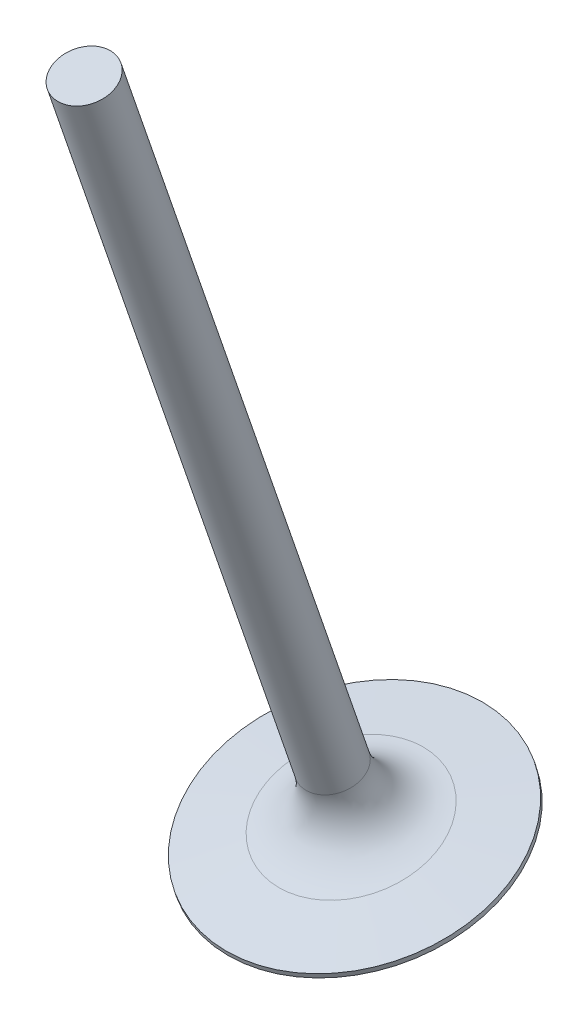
ISO-10303-21;
HEADER;
FILE_DESCRIPTION(('STEP AP214'),'2;1');
FILE_NAME('part.step','',(''),(''),'','','');
FILE_SCHEMA(('AUTOMOTIVE_DESIGN { 1 0 10303 214 1 1 1 1 }'));
ENDSEC;
DATA;
#1=APPLICATION_CONTEXT('core data for automotive mechanical design processes');
#2=APPLICATION_PROTOCOL_DEFINITION('international standard','automotive_design',2000,#1);
#3=PRODUCT_CONTEXT('',#1,'mechanical');
#4=PRODUCT('Part','Part','',(#3));
#5=PRODUCT_RELATED_PRODUCT_CATEGORY('part','',(#4));
#6=PRODUCT_DEFINITION_FORMATION('','',#4);
#7=PRODUCT_DEFINITION_CONTEXT('part definition',#1,'design');
#8=PRODUCT_DEFINITION('design','',#6,#7);
#9=PRODUCT_DEFINITION_SHAPE('','',#8);
#10=(LENGTH_UNIT() NAMED_UNIT(*) SI_UNIT(.MILLI.,.METRE.));
#11=(NAMED_UNIT(*) PLANE_ANGLE_UNIT() SI_UNIT($,.RADIAN.));
#12=(NAMED_UNIT(*) SI_UNIT($,.STERADIAN.) SOLID_ANGLE_UNIT());
#13=UNCERTAINTY_MEASURE_WITH_UNIT(LENGTH_MEASURE(1.E-05),#10,'distance_accuracy_value','');
#14=(GEOMETRIC_REPRESENTATION_CONTEXT(3) GLOBAL_UNCERTAINTY_ASSIGNED_CONTEXT((#13)) GLOBAL_UNIT_ASSIGNED_CONTEXT((#10,
#11,#12)) REPRESENTATION_CONTEXT('',''));
#15=CARTESIAN_POINT('',(0.,0.,0.));
#16=DIRECTION('',(0.,0.,1.));
#17=DIRECTION('',(1.,0.,0.));
#18=AXIS2_PLACEMENT_3D('',#15,#16,#17);
#19=CARTESIAN_POINT('',(-782.657553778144,-236.187915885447,-447.506943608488));
#20=DIRECTION('',(0.,0.945518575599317,0.325568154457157));
#21=DIRECTION('',(0.,-0.325568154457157,0.945518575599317));
#22=AXIS2_PLACEMENT_3D('',#19,#20,#21);
#23=PLANE('',#22);
#24=CARTESIAN_POINT('',(-782.657553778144,-236.187915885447,-447.506943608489));
#25=DIRECTION('',(0.,0.945518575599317,0.325568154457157));
#26=DIRECTION('',(0.,-0.325568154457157,0.945518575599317));
#27=AXIS2_PLACEMENT_3D('',#24,#25,#26);
#28=CIRCLE('',#27,2.98450000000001);
#29=CARTESIAN_POINT('',(-782.657553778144,-237.159574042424,-444.685043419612));
#30=VERTEX_POINT('',#29);
#31=EDGE_CURVE('E38',#30,#30,#28,.F.);
#32=ORIENTED_EDGE('',*,*,#31,.F.);
#33=EDGE_LOOP('',(#32));
#34=FACE_BOUND('',#33,.T.);
#35=ADVANCED_FACE('F34',(#34),#23,.T.);
#36=CARTESIAN_POINT('',(-782.657553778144,-313.998450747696,-474.299259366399));
#37=DIRECTION('',(0.,0.945518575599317,0.325568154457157));
#38=DIRECTION('',(0.,-0.325568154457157,0.945518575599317));
#39=AXIS2_PLACEMENT_3D('',#36,#37,#38);
#40=CYLINDRICAL_SURFACE('',#39,2.98450000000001);
#41=CARTESIAN_POINT('',(-782.657553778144,-313.998450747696,-474.299259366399));
#42=DIRECTION('',(0.,-0.945518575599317,-0.325568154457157));
#43=DIRECTION('',(0.,-0.325568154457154,0.945518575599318));
#44=AXIS2_PLACEMENT_3D('',#41,#42,#43);
#45=CIRCLE('',#44,2.98449999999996);
#46=CARTESIAN_POINT('',(-782.657553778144,-314.970108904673,-471.477359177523));
#47=VERTEX_POINT('',#46);
#48=EDGE_CURVE('E53',#47,#47,#45,.T.);
#49=ORIENTED_EDGE('',*,*,#48,.F.);
#50=EDGE_LOOP('',(#49));
#51=FACE_BOUND('',#50,.T.);
#52=ORIENTED_EDGE('',*,*,#31,.T.);
#53=EDGE_LOOP('',(#52));
#54=FACE_BOUND('',#53,.T.);
#55=ADVANCED_FACE('F60',(#51,#54),#40,.T.);
#56=CARTESIAN_POINT('',(-782.657553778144,-313.998450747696,-474.299259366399));
#57=DIRECTION('',(0.,-0.945518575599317,-0.325568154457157));
#58=DIRECTION('',(0.,-0.325568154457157,0.945518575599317));
#59=AXIS2_PLACEMENT_3D('',#56,#57,#58);
#60=TOROIDAL_SURFACE('',#59,9.33449999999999,6.35);
#61=CARTESIAN_POINT('',(-782.657553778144,-319.912753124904,-476.335716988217));
#62=DIRECTION('',(0.,-0.945518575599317,-0.325568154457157));
#63=DIRECTION('',(0.,-0.325568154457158,0.945518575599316));
#64=AXIS2_PLACEMENT_3D('',#61,#62,#63);
#65=CIRCLE('',#64,8.24071403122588);
#66=CARTESIAN_POINT('',(-782.657553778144,-322.59566718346,-468.543968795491));
#67=VERTEX_POINT('',#66);
#68=EDGE_CURVE('E47',#67,#67,#65,.T.);
#69=ORIENTED_EDGE('',*,*,#68,.F.);
#70=EDGE_LOOP('',(#69));
#71=FACE_BOUND('',#70,.T.);
#72=ORIENTED_EDGE('',*,*,#48,.T.);
#73=EDGE_LOOP('',(#72));
#74=FACE_BOUND('',#73,.T.);
#75=ADVANCED_FACE('F67',(#71,#74),#60,.F.);
#76=CARTESIAN_POINT('',(-782.657553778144,-321.445325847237,-476.86342409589));
#77=DIRECTION('',(0.,-0.945518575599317,-0.325568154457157));
#78=DIRECTION('',(0.,0.325568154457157,-0.945518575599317));
#79=AXIS2_PLACEMENT_3D('',#76,#77,#78);
#80=PLANE('',#79);
#81=CARTESIAN_POINT('',(-782.657553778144,-321.445325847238,-476.863424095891));
#82=DIRECTION('',(0.,0.945518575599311,0.325568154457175));
#83=DIRECTION('',(0.,-0.325568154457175,0.945518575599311));
#84=AXIS2_PLACEMENT_3D('',#81,#82,#83);
#85=CIRCLE('',#84,14.605);
#86=CARTESIAN_POINT('',(-782.657553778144,-326.200248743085,-463.054125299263));
#87=VERTEX_POINT('',#86);
#88=EDGE_CURVE('E42',#87,#87,#85,.T.);
#89=ORIENTED_EDGE('',*,*,#88,.F.);
#90=EDGE_LOOP('',(#89));
#91=FACE_BOUND('',#90,.T.);
#92=ADVANCED_FACE('F76',(#91),#80,.T.);
#93=CARTESIAN_POINT('',(-782.657553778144,-320.965002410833,-476.698035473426));
#94=DIRECTION('',(0.,-0.945518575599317,-0.325568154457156));
#95=DIRECTION('',(0.,0.325568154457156,-0.945518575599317));
#96=AXIS2_PLACEMENT_3D('',#93,#94,#95);
#97=CONICAL_SURFACE('',#96,14.605,1.39768321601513);
#98=ORIENTED_EDGE('',*,*,#68,.T.);
#99=EDGE_LOOP('',(#98));
#100=FACE_BOUND('',#99,.T.);
#101=CARTESIAN_POINT('',(-782.657553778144,-320.965002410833,-476.698035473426));
#102=DIRECTION('',(0.,0.945518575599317,0.325568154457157));
#103=DIRECTION('',(0.,0.325568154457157,-0.945518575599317));
#104=AXIS2_PLACEMENT_3D('',#101,#102,#103);
#105=CIRCLE('',#104,14.605);
#106=CARTESIAN_POINT('',(-782.657553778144,-316.210079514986,-490.507334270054));
#107=VERTEX_POINT('',#106);
#108=EDGE_CURVE('E10',#107,#107,#105,.F.);
#109=ORIENTED_EDGE('',*,*,#108,.F.);
#110=EDGE_LOOP('',(#109));
#111=FACE_BOUND('',#110,.T.);
#112=ADVANCED_FACE('F71',(#100,#111),#97,.T.);
#113=CARTESIAN_POINT('',(-782.657553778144,-321.445325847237,-476.86342409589));
#114=DIRECTION('',(0.,0.945518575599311,0.325568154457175));
#115=DIRECTION('',(0.,-0.325568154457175,0.945518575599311));
#116=AXIS2_PLACEMENT_3D('',#113,#114,#115);
#117=CYLINDRICAL_SURFACE('',#116,14.605);
#118=ORIENTED_EDGE('',*,*,#88,.T.);
#119=EDGE_LOOP('',(#118));
#120=FACE_BOUND('',#119,.T.);
#121=ORIENTED_EDGE('',*,*,#108,.T.);
#122=EDGE_LOOP('',(#121));
#123=FACE_BOUND('',#122,.T.);
#124=ADVANCED_FACE('F36',(#120,#123),#117,.T.);
#125=CLOSED_SHELL('',(#35,#55,#75,#92,#112,#124));
#126=MANIFOLD_SOLID_BREP('B2',#125);
#127=ADVANCED_BREP_SHAPE_REPRESENTATION('',(#18,#126),#14);
#128=SHAPE_DEFINITION_REPRESENTATION(#9,#127);
ENDSEC;
END-ISO-10303-21;
